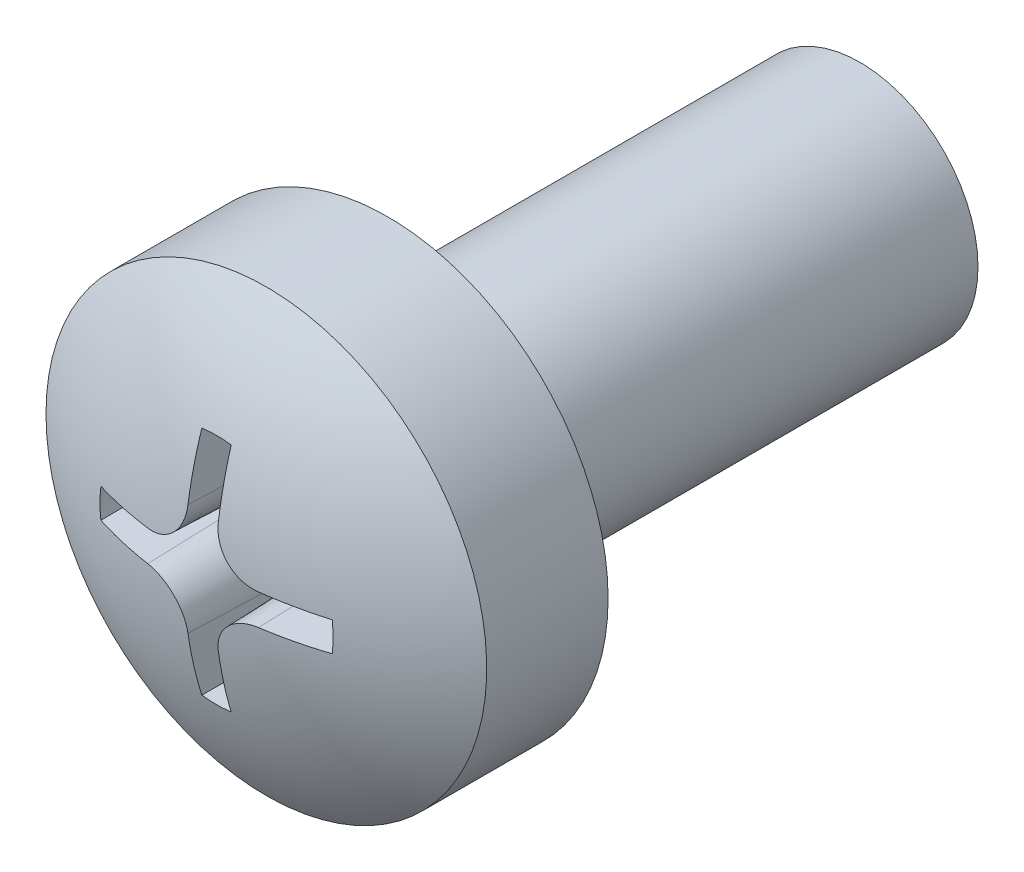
from build123d import *

# Parameters (mm, degrees)
SKETCH1_R          = 1.5
BASE_EXTRUDE_DEPTH = 6
CUT_EXTRUDE1_DEPTH = 1.799999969
CUT_EXTRUDE1_TAPER = 2


with BuildPart() as part:
    # Sketch1 → Base-Extrude (new body)
    with BuildSketch(Plane.XY):
        Circle(SKETCH1_R)
    extrude(amount=BASE_EXTRUDE_DEPTH)

    # Sketch6 → Boss-Revolve2 (revolve)
    with BuildSketch(Plane(origin=(0, 0, 0), x_dir=(1, 0, 0), z_dir=(0, 1, 0)), mode=Mode.PRIVATE) as boss_revolve2_sk:
        with BuildLine():
            Line((0, -6), (2.7999999, -6))
            Line((2.7999999, -6), (2.7999999, -7.54246308))
            ThreePointArc((2.7999999, -7.54246308), (1.46418655, -8.180811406), (0, -8.4))
            Line((0, -8.4), (0, -6))
        make_face()
    revolve(boss_revolve2_sk.sketch.rotate(Axis((0, 0, -0.393620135), (0, 0, 1)), 180), axis=Axis((0, 0, -0.393620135), (0, 0, 1)))

    # Sketch7 → Cut-Extrude1 (cut)
    with BuildSketch(Plane(origin=(0, 0, 8.7000001), x_dir=(-1, 0, 0), z_dir=(0, 0, -1))):
        with BuildLine():
            ThreePointArc((0.205000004, 1.48592565), (0, 1.500000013), (-0.205000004, 1.48592565))
            Line((-0.205000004, 1.48592565), (-0.205000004, 0.708178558))
            ThreePointArc((-0.205000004, 0.708178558), (-0.35072876, 0.355344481), (-0.702967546, 0.208182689))
            Line((-0.702967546, 0.208182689), (-1.48592565, 0.205000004))
            ThreePointArc((-1.48592565, 0.205000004), (-1.500000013, 0), (-1.48592565, -0.205000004))
            Line((-1.48592565, -0.205000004), (-0.702967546, -0.208182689))
            ThreePointArc((-0.702967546, -0.208182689), (-0.35072876, -0.355344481), (-0.205000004, -0.708178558))
            Line((-0.205000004, -0.708178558), (-0.205000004, -1.48592565))
            ThreePointArc((-0.205000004, -1.48592565), (0, -1.500000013), (0.205000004, -1.48592565))
            Line((0.205000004, -1.48592565), (0.205000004, -0.708178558))
            ThreePointArc((0.205000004, -0.708178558), (0.35072876, -0.355344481), (0.702967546, -0.208182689))
            Line((0.702967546, -0.208182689), (1.48592565, -0.205000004))
            ThreePointArc((1.48592565, -0.205000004), (1.500000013, 0), (1.48592565, 0.205000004))
            Line((1.48592565, 0.205000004), (0.702967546, 0.208182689))
            ThreePointArc((0.702967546, 0.208182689), (0.35072876, 0.355344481), (0.205000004, 0.708178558))
            Line((0.205000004, 0.708178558), (0.205000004, 1.48592565))
        make_face()
    extrude(amount=CUT_EXTRUDE1_DEPTH, taper=CUT_EXTRUDE1_TAPER, mode=Mode.SUBTRACT)


solid = part.part
